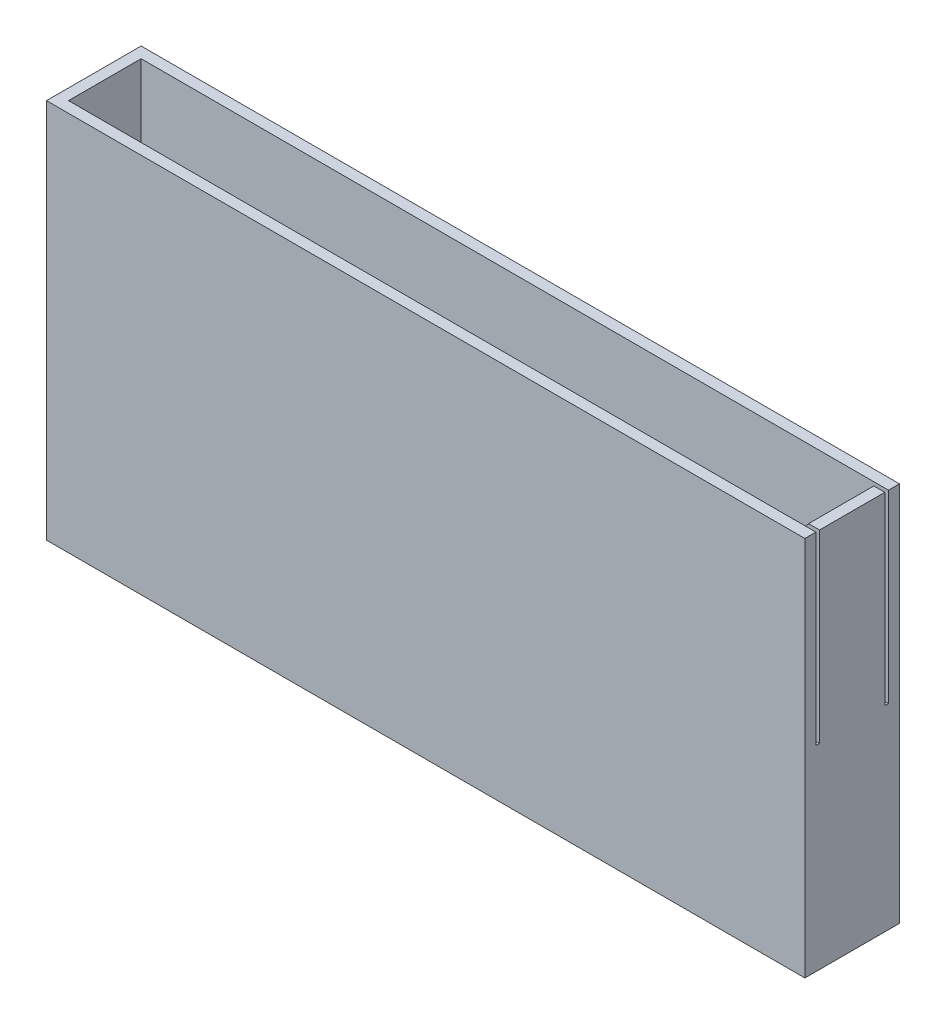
from build123d import *

# Parameters (mm, degrees)
SKETCH1_W           = 103.4
SKETCH1_H           = 12.9
SKETCH1_W_2         = 100.4
SKETCH1_H_2         = 9.9
BOSS_EXTRUDE1_DEPTH = 50.4
SKETCH2_W           = 103.4
SKETCH2_H           = 12.9
BOSS_EXTRUDE2_DEPTH = 1.5
SKETCH3_W           = 82.4
SKETCH3_H           = 9.9
CUT_EXTRUDE1_DEPTH  = 1.5
SKETCH6_W           = 0.5
SKETCH6_H           = 25.2
CUT_EXTRUDE3_DEPTH  = 1.5
BOSS_EXTRUDE4_DEPTH = 8.9


with BuildPart() as part:
    # Sketch1 → Boss-Extrude1 (new body)
    with BuildSketch(Plane(origin=(0, 0, 0), x_dir=(1, 0, 0), z_dir=(0, 1, 0))):
        with Locations((51.7, 6.45)):
            Rectangle(SKETCH1_W, SKETCH1_H)
        with Locations((51.7, 6.45)):
            Rectangle(SKETCH1_W_2, SKETCH1_H_2, mode=Mode.SUBTRACT)
    extrude(amount=BOSS_EXTRUDE1_DEPTH)

    # Sketch2 → Boss-Extrude2 (add)
    with BuildSketch(Plane(origin=(0, 0, 0), x_dir=(-1, 0, 0), z_dir=(0, -1, 0))):
        with Locations((-51.7, 6.45)):
            Rectangle(SKETCH2_W, SKETCH2_H)
    extrude(amount=BOSS_EXTRUDE2_DEPTH)

    # Sketch3 → Cut-Extrude1 (cut)
    with BuildSketch(Plane(origin=(0, 0, 0), x_dir=(1, 0, 0), z_dir=(0, 1, 0))):
        with Locations((51.7, 6.45)):
            Rectangle(SKETCH3_W, SKETCH3_H)
    extrude(amount=-CUT_EXTRUDE1_DEPTH, mode=Mode.SUBTRACT)

    # Sketch6 → Cut-Extrude3 (cut)
    with BuildSketch(Plane.ZY.offset(-101.9)):
        with Locations((-11.15, 37.8)):
            Rectangle(SKETCH6_W, SKETCH6_H)
        with Locations((-1.75, 37.8)):
            Rectangle(SKETCH6_W, SKETCH6_H)
    extrude(amount=-CUT_EXTRUDE3_DEPTH, mode=Mode.SUBTRACT)

    # Sketch8 → Boss-Extrude4 (add)
    with BuildSketch(Plane.XY.offset(-2)):
        Polygon((101.9, 50.4), (100.9, 49.15), (101.9, 47.9), align=None)
    extrude(amount=-BOSS_EXTRUDE4_DEPTH)


solid = part.part
